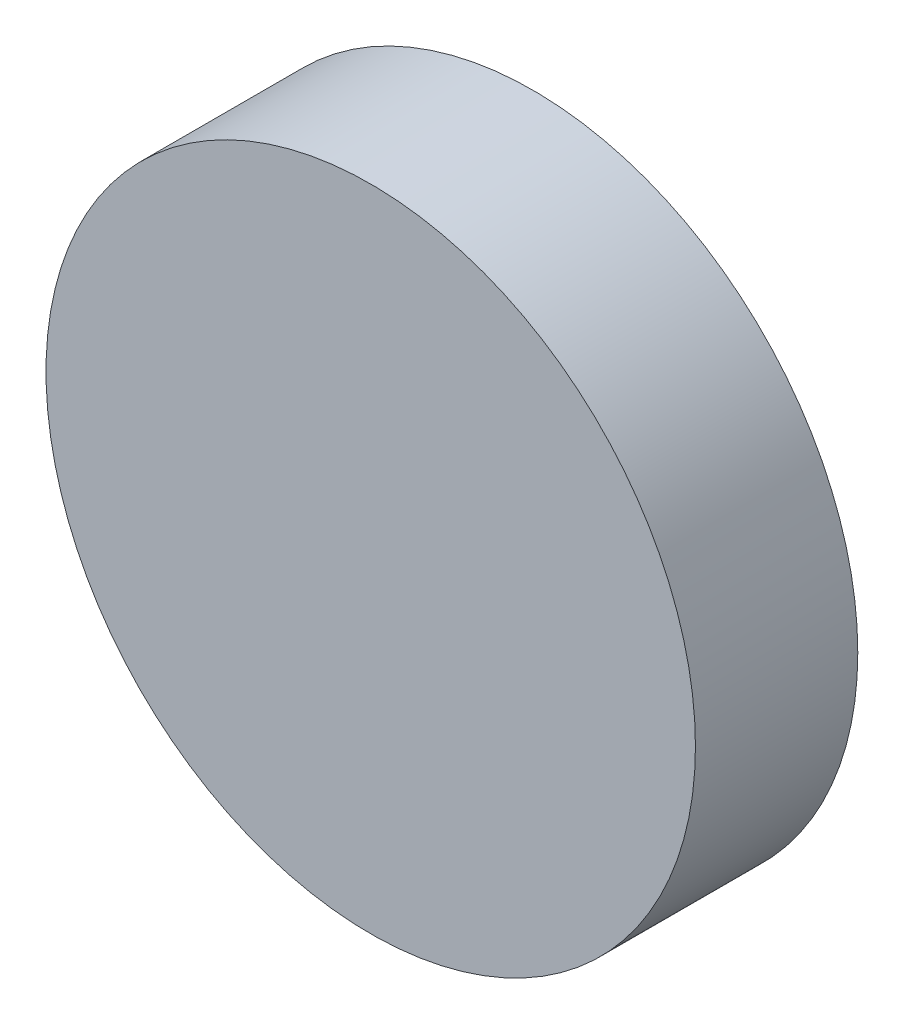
ISO-10303-21;
HEADER;
FILE_DESCRIPTION(('STEP AP214'),'2;1');
FILE_NAME('part.step','',(''),(''),'','','');
FILE_SCHEMA(('AUTOMOTIVE_DESIGN { 1 0 10303 214 1 1 1 1 }'));
ENDSEC;
DATA;
#1=APPLICATION_CONTEXT('core data for automotive mechanical design processes');
#2=APPLICATION_PROTOCOL_DEFINITION('international standard','automotive_design',2000,#1);
#3=PRODUCT_CONTEXT('',#1,'mechanical');
#4=PRODUCT('Part','Part','',(#3));
#5=PRODUCT_RELATED_PRODUCT_CATEGORY('part','',(#4));
#6=PRODUCT_DEFINITION_FORMATION('','',#4);
#7=PRODUCT_DEFINITION_CONTEXT('part definition',#1,'design');
#8=PRODUCT_DEFINITION('design','',#6,#7);
#9=PRODUCT_DEFINITION_SHAPE('','',#8);
#10=(LENGTH_UNIT() NAMED_UNIT(*) SI_UNIT(.MILLI.,.METRE.));
#11=(NAMED_UNIT(*) PLANE_ANGLE_UNIT() SI_UNIT($,.RADIAN.));
#12=(NAMED_UNIT(*) SI_UNIT($,.STERADIAN.) SOLID_ANGLE_UNIT());
#13=UNCERTAINTY_MEASURE_WITH_UNIT(LENGTH_MEASURE(1.E-05),#10,'distance_accuracy_value','');
#14=(GEOMETRIC_REPRESENTATION_CONTEXT(3) GLOBAL_UNCERTAINTY_ASSIGNED_CONTEXT((#13)) GLOBAL_UNIT_ASSIGNED_CONTEXT((#10,
#11,#12)) REPRESENTATION_CONTEXT('',''));
#15=CARTESIAN_POINT('',(0.,0.,0.));
#16=DIRECTION('',(0.,0.,1.));
#17=DIRECTION('',(1.,0.,0.));
#18=AXIS2_PLACEMENT_3D('',#15,#16,#17);
#19=CARTESIAN_POINT('',(0.,0.,-20.));
#20=DIRECTION('',(0.,0.,1.));
#21=DIRECTION('',(1.,0.,0.));
#22=AXIS2_PLACEMENT_3D('',#19,#20,#21);
#23=CYLINDRICAL_SURFACE('',#22,80.);
#24=CARTESIAN_POINT('',(0.,0.,-20.));
#25=DIRECTION('',(0.,0.,1.));
#26=DIRECTION('',(1.,0.,0.));
#27=AXIS2_PLACEMENT_3D('',#24,#25,#26);
#28=CIRCLE('',#27,80.);
#29=CARTESIAN_POINT('',(80.,0.,-20.));
#30=VERTEX_POINT('',#29);
#31=EDGE_CURVE('E10',#30,#30,#28,.T.);
#32=ORIENTED_EDGE('',*,*,#31,.T.);
#33=EDGE_LOOP('',(#32));
#34=FACE_BOUND('',#33,.T.);
#35=CARTESIAN_POINT('',(0.,0.,20.));
#36=DIRECTION('',(0.,0.,1.));
#37=DIRECTION('',(1.,0.,0.));
#38=AXIS2_PLACEMENT_3D('',#35,#36,#37);
#39=CIRCLE('',#38,80.);
#40=CARTESIAN_POINT('',(80.,0.,20.));
#41=VERTEX_POINT('',#40);
#42=EDGE_CURVE('E44',#41,#41,#39,.T.);
#43=ORIENTED_EDGE('',*,*,#42,.F.);
#44=EDGE_LOOP('',(#43));
#45=FACE_BOUND('',#44,.T.);
#46=ADVANCED_FACE('F39',(#34,#45),#23,.T.);
#47=CARTESIAN_POINT('',(0.,0.,-20.));
#48=DIRECTION('',(0.,0.,1.));
#49=DIRECTION('',(1.,0.,0.));
#50=AXIS2_PLACEMENT_3D('',#47,#48,#49);
#51=PLANE('',#50);
#52=ORIENTED_EDGE('',*,*,#31,.F.);
#53=EDGE_LOOP('',(#52));
#54=FACE_BOUND('',#53,.T.);
#55=ADVANCED_FACE('F53',(#54),#51,.F.);
#56=CARTESIAN_POINT('',(0.,0.,20.));
#57=DIRECTION('',(0.,0.,1.));
#58=DIRECTION('',(1.,0.,0.));
#59=AXIS2_PLACEMENT_3D('',#56,#57,#58);
#60=PLANE('',#59);
#61=ORIENTED_EDGE('',*,*,#42,.T.);
#62=EDGE_LOOP('',(#61));
#63=FACE_BOUND('',#62,.T.);
#64=ADVANCED_FACE('F51',(#63),#60,.T.);
#65=CLOSED_SHELL('',(#46,#55,#64));
#66=MANIFOLD_SOLID_BREP('B2',#65);
#67=ADVANCED_BREP_SHAPE_REPRESENTATION('',(#18,#66),#14);
#68=SHAPE_DEFINITION_REPRESENTATION(#9,#67);
ENDSEC;
END-ISO-10303-21;
